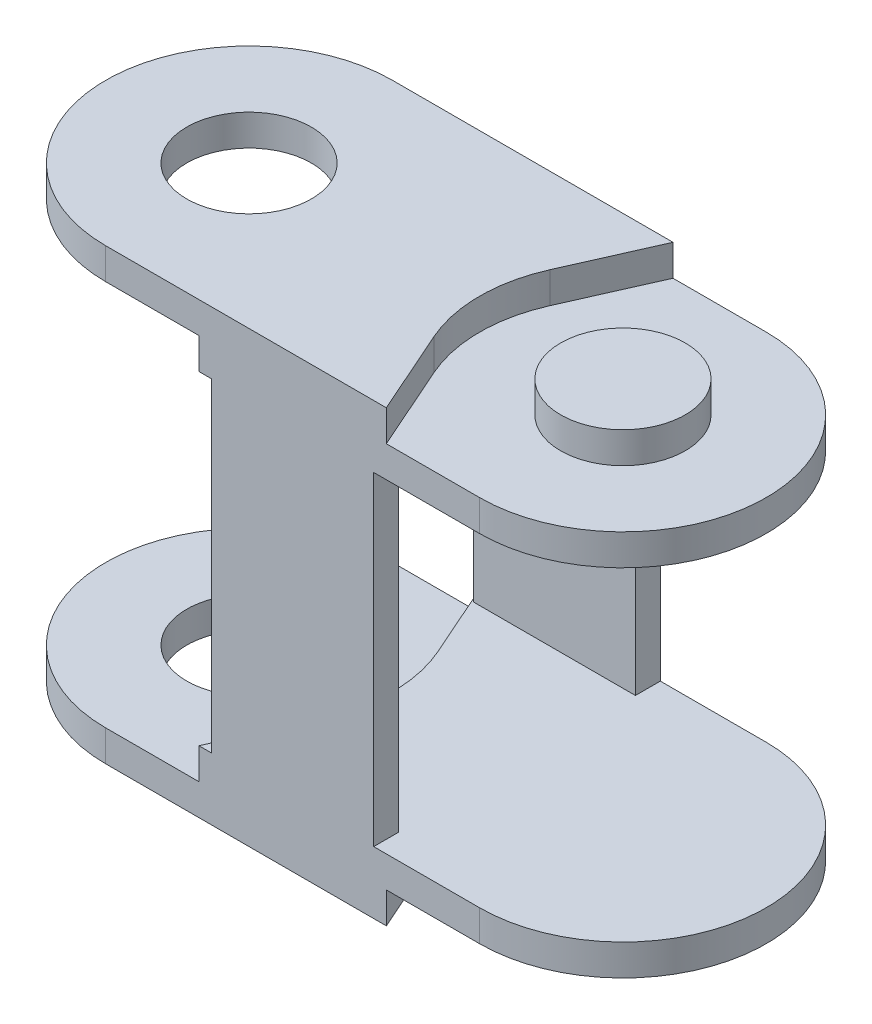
ISO-10303-21;
HEADER;
FILE_DESCRIPTION(('STEP AP214'),'2;1');
FILE_NAME('part.step','',(''),(''),'','','');
FILE_SCHEMA(('AUTOMOTIVE_DESIGN { 1 0 10303 214 1 1 1 1 }'));
ENDSEC;
DATA;
#1=APPLICATION_CONTEXT('core data for automotive mechanical design processes');
#2=APPLICATION_PROTOCOL_DEFINITION('international standard','automotive_design',2000,#1);
#3=PRODUCT_CONTEXT('',#1,'mechanical');
#4=PRODUCT('Part','Part','',(#3));
#5=PRODUCT_RELATED_PRODUCT_CATEGORY('part','',(#4));
#6=PRODUCT_DEFINITION_FORMATION('','',#4);
#7=PRODUCT_DEFINITION_CONTEXT('part definition',#1,'design');
#8=PRODUCT_DEFINITION('design','',#6,#7);
#9=PRODUCT_DEFINITION_SHAPE('','',#8);
#10=(LENGTH_UNIT() NAMED_UNIT(*) SI_UNIT(.MILLI.,.METRE.));
#11=(NAMED_UNIT(*) PLANE_ANGLE_UNIT() SI_UNIT($,.RADIAN.));
#12=(NAMED_UNIT(*) SI_UNIT($,.STERADIAN.) SOLID_ANGLE_UNIT());
#13=UNCERTAINTY_MEASURE_WITH_UNIT(LENGTH_MEASURE(1.E-05),#10,'distance_accuracy_value','');
#14=(GEOMETRIC_REPRESENTATION_CONTEXT(3) GLOBAL_UNCERTAINTY_ASSIGNED_CONTEXT((#13)) GLOBAL_UNIT_ASSIGNED_CONTEXT((#10,
#11,#12)) REPRESENTATION_CONTEXT('',''));
#15=CARTESIAN_POINT('',(0.,0.,0.));
#16=DIRECTION('',(0.,0.,1.));
#17=DIRECTION('',(1.,0.,0.));
#18=AXIS2_PLACEMENT_3D('',#15,#16,#17);
#19=CARTESIAN_POINT('',(9.99999999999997,-18.,5.63690605E-07));
#20=DIRECTION('',(0.,-1.,0.));
#21=DIRECTION('',(0.,0.,-1.));
#22=AXIS2_PLACEMENT_3D('',#19,#20,#21);
#23=PLANE('',#22);
#24=CARTESIAN_POINT('',(15.,-18.,8.45535737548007E-07));
#25=DIRECTION('',(0.,-1.,0.));
#26=DIRECTION('',(1.,0.,0.));
#27=AXIS2_PLACEMENT_3D('',#24,#25,#26);
#28=CIRCLE('',#27,5.);
#29=CARTESIAN_POINT('',(20.,-18.,8.45535737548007E-07));
#30=VERTEX_POINT('',#29);
#31=EDGE_CURVE('E18',#30,#30,#28,.F.);
#32=ORIENTED_EDGE('',*,*,#31,.F.);
#33=EDGE_LOOP('',(#32));
#34=FACE_BOUND('',#33,.T.);
#35=ADVANCED_FACE('F14',(#34),#23,.T.);
#36=CARTESIAN_POINT('',(20.1000005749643,18.,-5.09999915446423));
#37=DIRECTION('',(0.,1.,0.));
#38=DIRECTION('',(-0.999999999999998,0.,-5.63690533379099E-08));
#39=AXIS2_PLACEMENT_3D('',#36,#37,#38);
#40=PLANE('',#39);
#41=CARTESIAN_POINT('',(15.,18.,8.45535736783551E-07));
#42=DIRECTION('',(0.,1.,0.));
#43=DIRECTION('',(-1.,0.,0.));
#44=AXIS2_PLACEMENT_3D('',#41,#42,#43);
#45=CIRCLE('',#44,5.);
#46=CARTESIAN_POINT('',(10.,18.,8.45535736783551E-07));
#47=VERTEX_POINT('',#46);
#48=EDGE_CURVE('E313',#47,#47,#45,.F.);
#49=ORIENTED_EDGE('',*,*,#48,.F.);
#50=EDGE_LOOP('',(#49));
#51=FACE_BOUND('',#50,.T.);
#52=ADVANCED_FACE('F403',(#51),#40,.T.);
#53=CARTESIAN_POINT('',(15.,-13.,8.45535737E-07));
#54=DIRECTION('',(0.,-1.,0.));
#55=DIRECTION('',(1.,0.,0.));
#56=AXIS2_PLACEMENT_3D('',#53,#54,#55);
#57=CYLINDRICAL_SURFACE('',#56,5.);
#58=CARTESIAN_POINT('',(15.,-15.5,8.45535737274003E-07));
#59=DIRECTION('',(0.,-1.,0.));
#60=DIRECTION('',(1.,0.,0.));
#61=AXIS2_PLACEMENT_3D('',#58,#59,#60);
#62=CIRCLE('',#61,5.);
#63=CARTESIAN_POINT('',(20.,-15.5,8.45535737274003E-07));
#64=VERTEX_POINT('',#63);
#65=EDGE_CURVE('E389',#64,#64,#62,.F.);
#66=ORIENTED_EDGE('',*,*,#65,.F.);
#67=EDGE_LOOP('',(#66));
#68=FACE_BOUND('',#67,.T.);
#69=ORIENTED_EDGE('',*,*,#31,.T.);
#70=EDGE_LOOP('',(#69));
#71=FACE_BOUND('',#70,.T.);
#72=ADVANCED_FACE('F400',(#68,#71),#57,.T.);
#73=CARTESIAN_POINT('',(15.,-15.5,8.45535737E-07));
#74=DIRECTION('',(0.,-1.,0.));
#75=DIRECTION('',(1.,0.,0.));
#76=AXIS2_PLACEMENT_3D('',#73,#74,#75);
#77=CYLINDRICAL_SURFACE('',#76,11.5);
#78=DIRECTION('',(0.,1.,0.));
#79=VECTOR('',#78,1.);
#80=CARTESIAN_POINT('',(4.48515768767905,-15.5,-4.65704662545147));
#81=LINE('',#80,#79);
#82=CARTESIAN_POINT('',(4.48515768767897,-15.5,-4.65704662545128));
#83=VERTEX_POINT('',#82);
#84=CARTESIAN_POINT('',(4.48515789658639,-18.,-4.65704709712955));
#85=VERTEX_POINT('',#84);
#86=EDGE_CURVE('E319',#83,#85,#81,.F.);
#87=ORIENTED_EDGE('',*,*,#86,.F.);
#88=CARTESIAN_POINT('',(15.,-15.5,8.45535737E-07));
#89=DIRECTION('',(0.,-1.,0.));
#90=DIRECTION('',(1.,0.,0.));
#91=AXIS2_PLACEMENT_3D('',#88,#89,#90);
#92=CIRCLE('',#91,11.5);
#93=CARTESIAN_POINT('',(4.48515716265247,-15.5,4.65704713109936));
#94=VERTEX_POINT('',#93);
#95=EDGE_CURVE('E392',#94,#83,#92,.T.);
#96=ORIENTED_EDGE('',*,*,#95,.F.);
#97=DIRECTION('',(0.,1.,0.));
#98=VECTOR('',#97,1.);
#99=CARTESIAN_POINT('',(4.48515716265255,-15.5,4.65704713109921));
#100=LINE('',#99,#98);
#101=CARTESIAN_POINT('',(4.48515728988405,-18.,4.65704741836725));
#102=VERTEX_POINT('',#101);
#103=EDGE_CURVE('E240',#102,#94,#100,.T.);
#104=ORIENTED_EDGE('',*,*,#103,.F.);
#105=CARTESIAN_POINT('',(15.,-18.,8.45535737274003E-07));
#106=DIRECTION('',(0.,-1.,0.));
#107=DIRECTION('',(1.,0.,0.));
#108=AXIS2_PLACEMENT_3D('',#105,#106,#107);
#109=CIRCLE('',#108,11.5);
#110=EDGE_CURVE('E385',#85,#102,#109,.F.);
#111=ORIENTED_EDGE('',*,*,#110,.F.);
#112=EDGE_LOOP('',(#87,#96,#104,#111));
#113=FACE_BOUND('',#112,.T.);
#114=ADVANCED_FACE('F479',(#113),#77,.F.);
#115=CARTESIAN_POINT('',(-15.0000000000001,-15.5,-8.45535737E-07));
#116=DIRECTION('',(0.,-1.,0.));
#117=DIRECTION('',(1.,0.,0.));
#118=AXIS2_PLACEMENT_3D('',#115,#116,#117);
#119=CYLINDRICAL_SURFACE('',#118,5.);
#120=CARTESIAN_POINT('',(-15.0000000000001,-15.5,-8.45535737E-07));
#121=DIRECTION('',(0.,-1.,0.));
#122=DIRECTION('',(1.,0.,0.));
#123=AXIS2_PLACEMENT_3D('',#120,#121,#122);
#124=CIRCLE('',#123,5.);
#125=CARTESIAN_POINT('',(-10.0000000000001,-15.5,-8.45535737E-07));
#126=VERTEX_POINT('',#125);
#127=EDGE_CURVE('E368',#126,#126,#124,.F.);
#128=ORIENTED_EDGE('',*,*,#127,.T.);
#129=EDGE_LOOP('',(#128));
#130=FACE_BOUND('',#129,.T.);
#131=CARTESIAN_POINT('',(-15.0000000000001,-18.,-8.45535736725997E-07));
#132=DIRECTION('',(0.,-1.,0.));
#133=DIRECTION('',(1.,0.,0.));
#134=AXIS2_PLACEMENT_3D('',#131,#132,#133);
#135=CIRCLE('',#134,5.);
#136=CARTESIAN_POINT('',(-10.0000000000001,-18.,-8.45535736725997E-07));
#137=VERTEX_POINT('',#136);
#138=EDGE_CURVE('E380',#137,#137,#135,.F.);
#139=ORIENTED_EDGE('',*,*,#138,.F.);
#140=EDGE_LOOP('',(#139));
#141=FACE_BOUND('',#140,.T.);
#142=ADVANCED_FACE('F475',(#130,#141),#119,.F.);
#143=CARTESIAN_POINT('',(-15.0000000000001,15.5,-8.45535740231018E-07));
#144=DIRECTION('',(0.,1.,0.));
#145=DIRECTION('',(-1.,0.,0.));
#146=AXIS2_PLACEMENT_3D('',#143,#144,#145);
#147=CYLINDRICAL_SURFACE('',#146,5.);
#148=CARTESIAN_POINT('',(-15.0000000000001,15.5,-8.45535740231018E-07));
#149=DIRECTION('',(0.,1.,0.));
#150=DIRECTION('',(-1.,0.,0.));
#151=AXIS2_PLACEMENT_3D('',#148,#149,#150);
#152=CIRCLE('',#151,5.);
#153=CARTESIAN_POINT('',(-20.0000000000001,15.5,-8.45535740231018E-07));
#154=VERTEX_POINT('',#153);
#155=EDGE_CURVE('E307',#154,#154,#152,.F.);
#156=ORIENTED_EDGE('',*,*,#155,.T.);
#157=EDGE_LOOP('',(#156));
#158=FACE_BOUND('',#157,.T.);
#159=CARTESIAN_POINT('',(-15.0000000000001,18.,-8.45535740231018E-07));
#160=DIRECTION('',(0.,1.,0.));
#161=DIRECTION('',(-1.,0.,0.));
#162=AXIS2_PLACEMENT_3D('',#159,#160,#161);
#163=CIRCLE('',#162,5.);
#164=CARTESIAN_POINT('',(-20.0000000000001,18.,-8.45535740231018E-07));
#165=VERTEX_POINT('',#164);
#166=EDGE_CURVE('E354',#165,#165,#163,.F.);
#167=ORIENTED_EDGE('',*,*,#166,.F.);
#168=EDGE_LOOP('',(#167));
#169=FACE_BOUND('',#168,.T.);
#170=ADVANCED_FACE('F478',(#158,#169),#147,.F.);
#171=CARTESIAN_POINT('',(15.,18.0000000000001,8.45535734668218E-07));
#172=DIRECTION('',(0.,-1.,0.));
#173=DIRECTION('',(1.,0.,0.));
#174=AXIS2_PLACEMENT_3D('',#171,#172,#173);
#175=CYLINDRICAL_SURFACE('',#174,11.5);
#176=CARTESIAN_POINT('',(15.,15.5000000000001,8.45535734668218E-07));
#177=DIRECTION('',(0.,-1.,0.));
#178=DIRECTION('',(1.,0.,0.));
#179=AXIS2_PLACEMENT_3D('',#176,#177,#178);
#180=CIRCLE('',#179,11.5);
#181=CARTESIAN_POINT('',(4.48515768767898,15.5000000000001,-4.65704662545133));
#182=VERTEX_POINT('',#181);
#183=CARTESIAN_POINT('',(4.48515716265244,15.5000000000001,4.65704713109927));
#184=VERTEX_POINT('',#183);
#185=EDGE_CURVE('E352',#182,#184,#180,.F.);
#186=ORIENTED_EDGE('',*,*,#185,.F.);
#187=DIRECTION('',(0.,-1.,0.));
#188=VECTOR('',#187,1.);
#189=CARTESIAN_POINT('',(4.48515768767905,16.75,-4.65704662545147));
#190=LINE('',#189,#188);
#191=CARTESIAN_POINT('',(4.48515768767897,18.,-4.65704662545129));
#192=VERTEX_POINT('',#191);
#193=EDGE_CURVE('E314',#192,#182,#190,.T.);
#194=ORIENTED_EDGE('',*,*,#193,.F.);
#195=CARTESIAN_POINT('',(15.,18.,8.45535734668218E-07));
#196=DIRECTION('',(0.,-1.,0.));
#197=DIRECTION('',(1.,0.,0.));
#198=AXIS2_PLACEMENT_3D('',#195,#196,#197);
#199=CIRCLE('',#198,11.5);
#200=CARTESIAN_POINT('',(4.48515728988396,18.,4.65704741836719));
#201=VERTEX_POINT('',#200);
#202=EDGE_CURVE('E357',#201,#192,#199,.T.);
#203=ORIENTED_EDGE('',*,*,#202,.F.);
#204=DIRECTION('',(0.,1.,0.));
#205=VECTOR('',#204,1.);
#206=CARTESIAN_POINT('',(4.48515716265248,16.75,4.65704713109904));
#207=LINE('',#206,#205);
#208=EDGE_CURVE('E311',#184,#201,#207,.T.);
#209=ORIENTED_EDGE('',*,*,#208,.F.);
#210=EDGE_LOOP('',(#186,#194,#203,#209));
#211=FACE_BOUND('',#210,.T.);
#212=ADVANCED_FACE('F677',(#211),#175,.F.);
#213=CARTESIAN_POINT('',(15.,15.5,8.45535736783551E-07));
#214=DIRECTION('',(0.,1.,0.));
#215=DIRECTION('',(-1.,0.,0.));
#216=AXIS2_PLACEMENT_3D('',#213,#214,#215);
#217=CYLINDRICAL_SURFACE('',#216,5.);
#218=CARTESIAN_POINT('',(15.,15.5,8.45535736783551E-07));
#219=DIRECTION('',(0.,1.,0.));
#220=DIRECTION('',(-1.,0.,0.));
#221=AXIS2_PLACEMENT_3D('',#218,#219,#220);
#222=CIRCLE('',#221,5.);
#223=CARTESIAN_POINT('',(10.,15.5,8.45535736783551E-07));
#224=VERTEX_POINT('',#223);
#225=EDGE_CURVE('E348',#224,#224,#222,.F.);
#226=ORIENTED_EDGE('',*,*,#225,.F.);
#227=EDGE_LOOP('',(#226));
#228=FACE_BOUND('',#227,.T.);
#229=ORIENTED_EDGE('',*,*,#48,.T.);
#230=EDGE_LOOP('',(#229));
#231=FACE_BOUND('',#230,.T.);
#232=ADVANCED_FACE('F669',(#228,#231),#217,.T.);
#233=CARTESIAN_POINT('',(-15.0000000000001,-15.5,-8.45535740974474E-07));
#234=DIRECTION('',(0.,1.,0.));
#235=DIRECTION('',(-1.,0.,0.));
#236=AXIS2_PLACEMENT_3D('',#233,#234,#235);
#237=CYLINDRICAL_SURFACE('',#236,11.5);
#238=CARTESIAN_POINT('',(-15.0000000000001,-13.,-8.45535741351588E-07));
#239=DIRECTION('',(0.,1.,0.));
#240=DIRECTION('',(-1.,0.,0.));
#241=AXIS2_PLACEMENT_3D('',#238,#239,#240);
#242=CIRCLE('',#241,11.5);
#243=CARTESIAN_POINT('',(-4.48515768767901,-13.,4.6570466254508));
#244=VERTEX_POINT('',#243);
#245=CARTESIAN_POINT('',(-4.48515716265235,-13.,-4.65704713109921));
#246=VERTEX_POINT('',#245);
#247=EDGE_CURVE('E340',#244,#246,#242,.T.);
#248=ORIENTED_EDGE('',*,*,#247,.T.);
#249=DIRECTION('',(0.,1.,0.));
#250=VECTOR('',#249,1.);
#251=CARTESIAN_POINT('',(-4.48515716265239,-14.25,-4.6570471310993));
#252=LINE('',#251,#250);
#253=CARTESIAN_POINT('',(-4.48515716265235,-15.5,-4.65704713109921));
#254=VERTEX_POINT('',#253);
#255=EDGE_CURVE('E305',#254,#246,#252,.T.);
#256=ORIENTED_EDGE('',*,*,#255,.F.);
#257=CARTESIAN_POINT('',(-15.0000000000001,-15.5,-8.45535740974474E-07));
#258=DIRECTION('',(0.,1.,0.));
#259=DIRECTION('',(-1.,0.,0.));
#260=AXIS2_PLACEMENT_3D('',#257,#258,#259);
#261=CIRCLE('',#260,11.5);
#262=CARTESIAN_POINT('',(-4.48515768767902,-15.5,4.65704662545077));
#263=VERTEX_POINT('',#262);
#264=EDGE_CURVE('E375',#254,#263,#261,.F.);
#265=ORIENTED_EDGE('',*,*,#264,.T.);
#266=DIRECTION('',(0.,-1.,0.));
#267=VECTOR('',#266,1.);
#268=CARTESIAN_POINT('',(-4.4851576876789,-14.25,4.65704662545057));
#269=LINE('',#268,#267);
#270=EDGE_CURVE('E309',#244,#263,#269,.T.);
#271=ORIENTED_EDGE('',*,*,#270,.F.);
#272=EDGE_LOOP('',(#248,#256,#265,#271));
#273=FACE_BOUND('',#272,.T.);
#274=ADVANCED_FACE('F666',(#273),#237,.F.);
#275=CARTESIAN_POINT('',(4.48515716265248,15.5,4.65704713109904));
#276=DIRECTION('',(0.914334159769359,0.,-0.404960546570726));
#277=DIRECTION('',(0.,1.,0.));
#278=AXIS2_PLACEMENT_3D('',#275,#276,#277);
#279=PLANE('',#278);
#280=DIRECTION('',(0.404960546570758,0.,0.914334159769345));
#281=VECTOR('',#280,1.);
#282=CARTESIAN_POINT('',(4.48515716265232,15.5000000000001,4.65704713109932));
#283=LINE('',#282,#281);
#284=CARTESIAN_POINT('',(7.51591574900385,15.5,11.5000004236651));
#285=VERTEX_POINT('',#284);
#286=EDGE_CURVE('E351',#184,#285,#283,.T.);
#287=ORIENTED_EDGE('',*,*,#286,.F.);
#288=ORIENTED_EDGE('',*,*,#208,.T.);
#289=DIRECTION('',(-0.404960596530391,0.,-0.914334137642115));
#290=VECTOR('',#289,1.);
#291=CARTESIAN_POINT('',(7.51591704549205,18.,11.5000023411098));
#292=LINE('',#291,#290);
#293=CARTESIAN_POINT('',(7.51591597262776,18.,11.5000004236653));
#294=VERTEX_POINT('',#293);
#295=EDGE_CURVE('E359',#294,#201,#292,.T.);
#296=ORIENTED_EDGE('',*,*,#295,.F.);
#297=DIRECTION('',(0.,1.,0.));
#298=VECTOR('',#297,1.);
#299=CARTESIAN_POINT('',(7.51591574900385,0.,11.5000004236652));
#300=LINE('',#299,#298);
#301=EDGE_CURVE('E256',#285,#294,#300,.T.);
#302=ORIENTED_EDGE('',*,*,#301,.F.);
#303=EDGE_LOOP('',(#287,#288,#296,#302));
#304=FACE_BOUND('',#303,.T.);
#305=ADVANCED_FACE('F668',(#304),#279,.T.);
#306=CARTESIAN_POINT('',(-4.48515768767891,-13.,4.65704662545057));
#307=DIRECTION('',(-0.914334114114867,0.,-0.404960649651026));
#308=DIRECTION('',(0.,-1.,0.));
#309=AXIS2_PLACEMENT_3D('',#306,#307,#308);
#310=PLANE('',#309);
#311=DIRECTION('',(-0.404960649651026,0.,0.914334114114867));
#312=VECTOR('',#311,1.);
#313=CARTESIAN_POINT('',(-4.48515768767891,-13.,4.65704662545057));
#314=LINE('',#313,#312);
#315=CARTESIAN_POINT('',(-7.5159170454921,-13.,11.4999995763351));
#316=VERTEX_POINT('',#315);
#317=EDGE_CURVE('E343',#316,#244,#314,.F.);
#318=ORIENTED_EDGE('',*,*,#317,.T.);
#319=ORIENTED_EDGE('',*,*,#270,.T.);
#320=DIRECTION('',(-0.404960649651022,0.,0.914334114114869));
#321=VECTOR('',#320,1.);
#322=CARTESIAN_POINT('',(-4.48515768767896,-15.5,4.65704662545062));
#323=LINE('',#322,#321);
#324=CARTESIAN_POINT('',(-7.51591704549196,-15.5,11.4999995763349));
#325=VERTEX_POINT('',#324);
#326=EDGE_CURVE('E374',#263,#325,#323,.T.);
#327=ORIENTED_EDGE('',*,*,#326,.T.);
#328=DIRECTION('',(0.,-1.,0.));
#329=VECTOR('',#328,1.);
#330=CARTESIAN_POINT('',(-7.51591704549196,0.,11.4999995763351));
#331=LINE('',#330,#329);
#332=EDGE_CURVE('E276',#316,#325,#331,.T.);
#333=ORIENTED_EDGE('',*,*,#332,.F.);
#334=EDGE_LOOP('',(#318,#319,#327,#333));
#335=FACE_BOUND('',#334,.T.);
#336=ADVANCED_FACE('F473',(#335),#310,.T.);
#337=CARTESIAN_POINT('',(7.51591574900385,-15.5,11.5000004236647));
#338=DIRECTION('',(0.914334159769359,0.,-0.404960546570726));
#339=DIRECTION('',(-0.404960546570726,0.,-0.914334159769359));
#340=AXIS2_PLACEMENT_3D('',#337,#338,#339);
#341=PLANE('',#340);
#342=DIRECTION('',(-0.404960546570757,0.,-0.914334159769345));
#343=VECTOR('',#342,1.);
#344=CARTESIAN_POINT('',(7.51591574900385,-15.5,11.5000004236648));
#345=LINE('',#344,#343);
#346=CARTESIAN_POINT('',(7.51591574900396,-15.5,11.5000004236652));
#347=VERTEX_POINT('',#346);
#348=EDGE_CURVE('E239',#347,#94,#345,.T.);
#349=ORIENTED_EDGE('',*,*,#348,.F.);
#350=DIRECTION('',(0.,1.,0.));
#351=VECTOR('',#350,1.);
#352=CARTESIAN_POINT('',(7.51591574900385,0.,11.5000004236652));
#353=LINE('',#352,#351);
#354=CARTESIAN_POINT('',(7.51591597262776,-18.,11.5000004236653));
#355=VERTEX_POINT('',#354);
#356=EDGE_CURVE('E265',#355,#347,#353,.T.);
#357=ORIENTED_EDGE('',*,*,#356,.F.);
#358=DIRECTION('',(0.404960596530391,0.,0.914334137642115));
#359=VECTOR('',#358,1.);
#360=CARTESIAN_POINT('',(4.48515716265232,-18.,4.65704713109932));
#361=LINE('',#360,#359);
#362=EDGE_CURVE('E383',#102,#355,#361,.T.);
#363=ORIENTED_EDGE('',*,*,#362,.F.);
#364=ORIENTED_EDGE('',*,*,#103,.T.);
#365=EDGE_LOOP('',(#349,#357,#363,#364));
#366=FACE_BOUND('',#365,.T.);
#367=ADVANCED_FACE('F470',(#366),#341,.T.);
#368=CARTESIAN_POINT('',(15.,-13.,8.45535736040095E-07));
#369=DIRECTION('',(0.,-1.,0.));
#370=DIRECTION('',(0.,0.,-1.));
#371=AXIS2_PLACEMENT_3D('',#368,#369,#370);
#372=CYLINDRICAL_SURFACE('',#371,11.5);
#373=CARTESIAN_POINT('',(15.,-12.9999999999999,8.45535736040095E-07));
#374=DIRECTION('',(0.,-1.,0.));
#375=DIRECTION('',(0.,0.,-1.));
#376=AXIS2_PLACEMENT_3D('',#373,#374,#375);
#377=CIRCLE('',#376,11.5);
#378=CARTESIAN_POINT('',(15.0000006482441,-13.,-11.4999991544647));
#379=VERTEX_POINT('',#378);
#380=CARTESIAN_POINT('',(14.9999993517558,-12.9999999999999,11.500000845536));
#381=VERTEX_POINT('',#380);
#382=EDGE_CURVE('E346',#379,#381,#377,.T.);
#383=ORIENTED_EDGE('',*,*,#382,.T.);
#384=DIRECTION('',(0.,1.,0.));
#385=VECTOR('',#384,1.);
#386=CARTESIAN_POINT('',(14.9999993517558,0.,11.5000008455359));
#387=LINE('',#386,#385);
#388=CARTESIAN_POINT('',(14.9999993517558,-15.5,11.500000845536));
#389=VERTEX_POINT('',#388);
#390=EDGE_CURVE('E235',#389,#381,#387,.T.);
#391=ORIENTED_EDGE('',*,*,#390,.F.);
#392=CARTESIAN_POINT('',(15.,-15.5,8.45535736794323E-07));
#393=DIRECTION('',(0.,-1.,0.));
#394=DIRECTION('',(0.,0.,-1.));
#395=AXIS2_PLACEMENT_3D('',#392,#393,#394);
#396=CIRCLE('',#395,11.5);
#397=CARTESIAN_POINT('',(15.0000006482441,-15.5,-11.4999991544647));
#398=VERTEX_POINT('',#397);
#399=EDGE_CURVE('E233',#398,#389,#396,.T.);
#400=ORIENTED_EDGE('',*,*,#399,.F.);
#401=DIRECTION('',(0.,1.,0.));
#402=VECTOR('',#401,1.);
#403=CARTESIAN_POINT('',(15.0000006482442,-15.5,-11.4999991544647));
#404=LINE('',#403,#402);
#405=EDGE_CURVE('E219',#379,#398,#404,.F.);
#406=ORIENTED_EDGE('',*,*,#405,.F.);
#407=EDGE_LOOP('',(#383,#391,#400,#406));
#408=FACE_BOUND('',#407,.T.);
#409=ADVANCED_FACE('F234',(#408),#372,.T.);
#410=CARTESIAN_POINT('',(3.26999998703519,-15.5,-11.5000008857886));
#411=DIRECTION('',(0.,-1.,0.));
#412=DIRECTION('',(0.999999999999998,0.,5.63690532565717E-08));
#413=AXIS2_PLACEMENT_3D('',#410,#411,#412);
#414=PLANE('',#413);
#415=ORIENTED_EDGE('',*,*,#65,.T.);
#416=EDGE_LOOP('',(#415));
#417=FACE_BOUND('',#416,.T.);
#418=ORIENTED_EDGE('',*,*,#348,.T.);
#419=ORIENTED_EDGE('',*,*,#95,.T.);
#420=DIRECTION('',(0.404960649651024,0.,-0.914334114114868));
#421=VECTOR('',#420,1.);
#422=CARTESIAN_POINT('',(4.48515768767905,-15.5,-4.65704662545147));
#423=LINE('',#422,#421);
#424=CARTESIAN_POINT('',(7.51591704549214,-15.5,-11.4999995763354));
#425=VERTEX_POINT('',#424);
#426=EDGE_CURVE('E245',#425,#83,#423,.F.);
#427=ORIENTED_EDGE('',*,*,#426,.F.);
#428=DIRECTION('',(-0.999999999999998,0.,-5.6369052E-08));
#429=VECTOR('',#428,1.);
#430=CARTESIAN_POINT('',(7.51591704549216,-15.5,-11.4999995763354));
#431=LINE('',#430,#429);
#432=EDGE_CURVE('E224',#398,#425,#431,.T.);
#433=ORIENTED_EDGE('',*,*,#432,.F.);
#434=ORIENTED_EDGE('',*,*,#399,.T.);
#435=DIRECTION('',(0.999999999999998,0.,5.63690521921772E-08));
#436=VECTOR('',#435,1.);
#437=CARTESIAN_POINT('',(-6.48244171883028E-07,-15.5,11.5000000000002));
#438=LINE('',#437,#436);
#439=EDGE_CURVE('E260',#347,#389,#438,.T.);
#440=ORIENTED_EDGE('',*,*,#439,.F.);
#441=EDGE_LOOP('',(#418,#419,#427,#433,#434,#440));
#442=FACE_BOUND('',#441,.T.);
#443=ADVANCED_FACE('F243',(#417,#442),#414,.T.);
#444=CARTESIAN_POINT('',(4.48515768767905,-15.5,-4.65704662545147));
#445=DIRECTION('',(0.914334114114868,0.,0.404960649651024));
#446=DIRECTION('',(0.404960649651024,0.,-0.914334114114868));
#447=AXIS2_PLACEMENT_3D('',#444,#445,#446);
#448=PLANE('',#447);
#449=ORIENTED_EDGE('',*,*,#426,.T.);
#450=ORIENTED_EDGE('',*,*,#86,.T.);
#451=DIRECTION('',(-0.404960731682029,0.,0.914334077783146));
#452=VECTOR('',#451,1.);
#453=CARTESIAN_POINT('',(7.51591834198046,-18.,-11.5000008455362));
#454=LINE('',#453,#452);
#455=CARTESIAN_POINT('',(7.51591741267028,-18.,-11.4999995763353));
#456=VERTEX_POINT('',#455);
#457=EDGE_CURVE('E321',#456,#85,#454,.T.);
#458=ORIENTED_EDGE('',*,*,#457,.F.);
#459=DIRECTION('',(0.,1.,0.));
#460=VECTOR('',#459,1.);
#461=CARTESIAN_POINT('',(7.51591704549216,-15.5,-11.4999995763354));
#462=LINE('',#461,#460);
#463=EDGE_CURVE('E247',#425,#456,#462,.F.);
#464=ORIENTED_EDGE('',*,*,#463,.F.);
#465=EDGE_LOOP('',(#449,#450,#458,#464));
#466=FACE_BOUND('',#465,.T.);
#467=ADVANCED_FACE('F466',(#466),#448,.T.);
#468=CARTESIAN_POINT('',(7.51591704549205,-18.,11.5000023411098));
#469=DIRECTION('',(0.,-1.,0.));
#470=DIRECTION('',(-0.999999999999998,0.,-5.63690534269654E-08));
#471=AXIS2_PLACEMENT_3D('',#468,#469,#470);
#472=PLANE('',#471);
#473=ORIENTED_EDGE('',*,*,#138,.T.);
#474=EDGE_LOOP('',(#473));
#475=FACE_BOUND('',#474,.T.);
#476=DIRECTION('',(0.999999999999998,0.,5.63690521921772E-08));
#477=VECTOR('',#476,1.);
#478=CARTESIAN_POINT('',(-6.48244171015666E-07,-18.,11.5000000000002));
#479=LINE('',#478,#477);
#480=CARTESIAN_POINT('',(-15.0000006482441,-18.,11.4999991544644));
#481=VERTEX_POINT('',#480);
#482=EDGE_CURVE('E267',#481,#355,#479,.T.);
#483=ORIENTED_EDGE('',*,*,#482,.F.);
#484=CARTESIAN_POINT('',(-15.0000000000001,-18.,-8.45535736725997E-07));
#485=DIRECTION('',(0.,-1.,0.));
#486=DIRECTION('',(1.,0.,0.));
#487=AXIS2_PLACEMENT_3D('',#484,#485,#486);
#488=CIRCLE('',#487,11.5);
#489=CARTESIAN_POINT('',(-14.9999993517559,-18.,-11.5000008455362));
#490=VERTEX_POINT('',#489);
#491=EDGE_CURVE('E378',#490,#481,#488,.F.);
#492=ORIENTED_EDGE('',*,*,#491,.F.);
#493=DIRECTION('',(-0.999999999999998,0.,-5.6369052E-08));
#494=VECTOR('',#493,1.);
#495=CARTESIAN_POINT('',(7.51591704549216,-18.,-11.4999995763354));
#496=LINE('',#495,#494);
#497=EDGE_CURVE('E249',#456,#490,#496,.T.);
#498=ORIENTED_EDGE('',*,*,#497,.F.);
#499=ORIENTED_EDGE('',*,*,#457,.T.);
#500=ORIENTED_EDGE('',*,*,#110,.T.);
#501=ORIENTED_EDGE('',*,*,#362,.T.);
#502=EDGE_LOOP('',(#483,#492,#498,#499,#500,#501));
#503=FACE_BOUND('',#502,.T.);
#504=ADVANCED_FACE('F464',(#475,#503),#472,.T.);
#505=CARTESIAN_POINT('',(-15.0000000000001,-15.5,-8.45535737E-07));
#506=DIRECTION('',(0.,-1.,0.));
#507=DIRECTION('',(1.,0.,0.));
#508=AXIS2_PLACEMENT_3D('',#505,#506,#507);
#509=CYLINDRICAL_SURFACE('',#508,11.5);
#510=CARTESIAN_POINT('',(-15.0000000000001,-15.5,-8.45535737E-07));
#511=DIRECTION('',(0.,-1.,0.));
#512=DIRECTION('',(1.,0.,0.));
#513=AXIS2_PLACEMENT_3D('',#510,#511,#512);
#514=CIRCLE('',#513,11.5);
#515=CARTESIAN_POINT('',(-15.0000006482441,-15.5,11.4999991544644));
#516=VERTEX_POINT('',#515);
#517=CARTESIAN_POINT('',(-14.9999993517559,-15.5,-11.5000008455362));
#518=VERTEX_POINT('',#517);
#519=EDGE_CURVE('E371',#516,#518,#514,.T.);
#520=ORIENTED_EDGE('',*,*,#519,.T.);
#521=DIRECTION('',(0.,1.,0.));
#522=VECTOR('',#521,1.);
#523=CARTESIAN_POINT('',(-14.9999993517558,-15.5,-11.5000008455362));
#524=LINE('',#523,#522);
#525=EDGE_CURVE('E617',#490,#518,#524,.T.);
#526=ORIENTED_EDGE('',*,*,#525,.F.);
#527=ORIENTED_EDGE('',*,*,#491,.T.);
#528=DIRECTION('',(0.,-1.,0.));
#529=VECTOR('',#528,1.);
#530=CARTESIAN_POINT('',(-15.0000006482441,0.,11.4999991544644));
#531=LINE('',#530,#529);
#532=EDGE_CURVE('E270',#516,#481,#531,.T.);
#533=ORIENTED_EDGE('',*,*,#532,.F.);
#534=EDGE_LOOP('',(#520,#526,#527,#533));
#535=FACE_BOUND('',#534,.T.);
#536=ADVANCED_FACE('F460',(#535),#509,.T.);
#537=CARTESIAN_POINT('',(-3.62473154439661,-15.5,-2.04323328E-07));
#538=DIRECTION('',(0.,-1.,0.));
#539=DIRECTION('',(0.,0.,-1.));
#540=AXIS2_PLACEMENT_3D('',#537,#538,#539);
#541=PLANE('',#540);
#542=ORIENTED_EDGE('',*,*,#127,.F.);
#543=EDGE_LOOP('',(#542));
#544=FACE_BOUND('',#543,.T.);
#545=DIRECTION('',(-0.999999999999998,0.,-5.6369052E-08));
#546=VECTOR('',#545,1.);
#547=CARTESIAN_POINT('',(7.51591704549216,-15.5,-11.4999995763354));
#548=LINE('',#547,#546);
#549=CARTESIAN_POINT('',(-7.51591574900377,-15.5,-11.5000004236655));
#550=VERTEX_POINT('',#549);
#551=EDGE_CURVE('E613',#518,#550,#548,.F.);
#552=ORIENTED_EDGE('',*,*,#551,.F.);
#553=ORIENTED_EDGE('',*,*,#519,.F.);
#554=DIRECTION('',(-0.999999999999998,0.,-5.63690521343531E-08));
#555=VECTOR('',#554,1.);
#556=CARTESIAN_POINT('',(-6.48244171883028E-07,-15.5,11.5000000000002));
#557=LINE('',#556,#555);
#558=EDGE_CURVE('E273',#325,#516,#557,.T.);
#559=ORIENTED_EDGE('',*,*,#558,.F.);
#560=ORIENTED_EDGE('',*,*,#326,.F.);
#561=ORIENTED_EDGE('',*,*,#264,.F.);
#562=DIRECTION('',(0.404960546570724,0.,0.914334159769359));
#563=VECTOR('',#562,1.);
#564=CARTESIAN_POINT('',(-6.00053645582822,-15.5,-8.07852377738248));
#565=LINE('',#564,#563);
#566=EDGE_CURVE('E308',#550,#254,#565,.T.);
#567=ORIENTED_EDGE('',*,*,#566,.F.);
#568=EDGE_LOOP('',(#552,#553,#559,#560,#561,#567));
#569=FACE_BOUND('',#568,.T.);
#570=ADVANCED_FACE('F456',(#544,#569),#541,.F.);
#571=CARTESIAN_POINT('',(-7.51591574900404,-13.,-11.5000004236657));
#572=DIRECTION('',(-0.914334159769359,0.,0.404960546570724));
#573=DIRECTION('',(0.,-1.,0.));
#574=AXIS2_PLACEMENT_3D('',#571,#572,#573);
#575=PLANE('',#574);
#576=DIRECTION('',(0.404960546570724,0.,0.914334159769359));
#577=VECTOR('',#576,1.);
#578=CARTESIAN_POINT('',(-7.51591574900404,-13.,-11.5000004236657));
#579=LINE('',#578,#577);
#580=CARTESIAN_POINT('',(-7.51591574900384,-13.,-11.5000004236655));
#581=VERTEX_POINT('',#580);
#582=EDGE_CURVE('E336',#246,#581,#579,.F.);
#583=ORIENTED_EDGE('',*,*,#582,.T.);
#584=DIRECTION('',(0.,1.,0.));
#585=VECTOR('',#584,1.);
#586=CARTESIAN_POINT('',(-7.51591574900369,-15.5,-11.5000004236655));
#587=LINE('',#586,#585);
#588=EDGE_CURVE('E611',#550,#581,#587,.T.);
#589=ORIENTED_EDGE('',*,*,#588,.F.);
#590=ORIENTED_EDGE('',*,*,#566,.T.);
#591=ORIENTED_EDGE('',*,*,#255,.T.);
#592=EDGE_LOOP('',(#583,#589,#590,#591));
#593=FACE_BOUND('',#592,.T.);
#594=ADVANCED_FACE('F459',(#593),#575,.T.);
#595=CARTESIAN_POINT('',(-3.26999869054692,15.5,-11.5000008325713));
#596=DIRECTION('',(0.,1.,0.));
#597=DIRECTION('',(-0.999999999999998,0.,-5.63690533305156E-08));
#598=AXIS2_PLACEMENT_3D('',#595,#596,#597);
#599=PLANE('',#598);
#600=ORIENTED_EDGE('',*,*,#155,.F.);
#601=EDGE_LOOP('',(#600));
#602=FACE_BOUND('',#601,.T.);
#603=CARTESIAN_POINT('',(-15.0000000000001,15.5,-8.45535737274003E-07));
#604=DIRECTION('',(0.,1.,0.));
#605=DIRECTION('',(-1.,0.,0.));
#606=AXIS2_PLACEMENT_3D('',#603,#604,#605);
#607=CIRCLE('',#606,11.5);
#608=CARTESIAN_POINT('',(-4.48515716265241,15.5,-4.65704713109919));
#609=VERTEX_POINT('',#608);
#610=CARTESIAN_POINT('',(-4.48515768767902,15.5,4.65704662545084));
#611=VERTEX_POINT('',#610);
#612=EDGE_CURVE('E289',#609,#611,#607,.F.);
#613=ORIENTED_EDGE('',*,*,#612,.T.);
#614=DIRECTION('',(-0.404960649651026,0.,0.914334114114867));
#615=VECTOR('',#614,1.);
#616=CARTESIAN_POINT('',(-7.51591704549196,15.5000000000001,11.4999995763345));
#617=LINE('',#616,#615);
#618=CARTESIAN_POINT('',(-7.51591704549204,15.5000000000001,11.499999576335));
#619=VERTEX_POINT('',#618);
#620=EDGE_CURVE('E287',#619,#611,#617,.F.);
#621=ORIENTED_EDGE('',*,*,#620,.F.);
#622=DIRECTION('',(0.999999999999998,0.,5.63690521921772E-08));
#623=VECTOR('',#622,1.);
#624=CARTESIAN_POINT('',(-6.48244180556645E-07,15.5000000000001,11.5000000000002));
#625=LINE('',#624,#623);
#626=CARTESIAN_POINT('',(-15.0000006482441,15.5,11.4999991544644));
#627=VERTEX_POINT('',#626);
#628=EDGE_CURVE('E290',#627,#619,#625,.T.);
#629=ORIENTED_EDGE('',*,*,#628,.F.);
#630=CARTESIAN_POINT('',(-15.0000000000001,15.5,-8.45535739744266E-07));
#631=DIRECTION('',(0.,1.,0.));
#632=DIRECTION('',(-1.,0.,0.));
#633=AXIS2_PLACEMENT_3D('',#630,#631,#632);
#634=CIRCLE('',#633,11.5);
#635=CARTESIAN_POINT('',(-14.9999993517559,15.5,-11.5000008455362));
#636=VERTEX_POINT('',#635);
#637=EDGE_CURVE('E364',#636,#627,#634,.T.);
#638=ORIENTED_EDGE('',*,*,#637,.F.);
#639=DIRECTION('',(-0.999999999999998,0.,-5.6369052E-08));
#640=VECTOR('',#639,1.);
#641=CARTESIAN_POINT('',(7.51591704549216,15.5,-11.4999995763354));
#642=LINE('',#641,#640);
#643=CARTESIAN_POINT('',(-7.51591574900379,15.5,-11.5000004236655));
#644=VERTEX_POINT('',#643);
#645=EDGE_CURVE('E572',#644,#636,#642,.T.);
#646=ORIENTED_EDGE('',*,*,#645,.F.);
#647=DIRECTION('',(0.404960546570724,0.,0.914334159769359));
#648=VECTOR('',#647,1.);
#649=CARTESIAN_POINT('',(-4.4851571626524,15.5,-4.65704713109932));
#650=LINE('',#649,#648);
#651=EDGE_CURVE('E564',#609,#644,#650,.F.);
#652=ORIENTED_EDGE('',*,*,#651,.F.);
#653=EDGE_LOOP('',(#613,#621,#629,#638,#646,#652));
#654=FACE_BOUND('',#653,.T.);
#655=ADVANCED_FACE('F502',(#602,#654),#599,.F.);
#656=CARTESIAN_POINT('',(-15.0000000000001,15.5,-8.45535739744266E-07));
#657=DIRECTION('',(0.,1.,0.));
#658=DIRECTION('',(-1.,0.,0.));
#659=AXIS2_PLACEMENT_3D('',#656,#657,#658);
#660=CYLINDRICAL_SURFACE('',#659,11.5);
#661=ORIENTED_EDGE('',*,*,#637,.T.);
#662=DIRECTION('',(0.,-1.,0.));
#663=VECTOR('',#662,1.);
#664=CARTESIAN_POINT('',(-15.0000006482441,0.,11.4999991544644));
#665=LINE('',#664,#663);
#666=CARTESIAN_POINT('',(-15.0000006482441,18.,11.4999991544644));
#667=VERTEX_POINT('',#666);
#668=EDGE_CURVE('E293',#667,#627,#665,.T.);
#669=ORIENTED_EDGE('',*,*,#668,.F.);
#670=CARTESIAN_POINT('',(-15.0000000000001,18.,-8.45535740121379E-07));
#671=DIRECTION('',(0.,1.,0.));
#672=DIRECTION('',(-1.,0.,0.));
#673=AXIS2_PLACEMENT_3D('',#670,#671,#672);
#674=CIRCLE('',#673,11.5);
#675=CARTESIAN_POINT('',(-14.9999993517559,18.,-11.5000008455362));
#676=VERTEX_POINT('',#675);
#677=EDGE_CURVE('E362',#676,#667,#674,.T.);
#678=ORIENTED_EDGE('',*,*,#677,.F.);
#679=DIRECTION('',(0.,1.,0.));
#680=VECTOR('',#679,1.);
#681=CARTESIAN_POINT('',(-14.9999993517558,-15.5,-11.5000008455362));
#682=LINE('',#681,#680);
#683=EDGE_CURVE('E604',#636,#676,#682,.T.);
#684=ORIENTED_EDGE('',*,*,#683,.F.);
#685=EDGE_LOOP('',(#661,#669,#678,#684));
#686=FACE_BOUND('',#685,.T.);
#687=ADVANCED_FACE('F506',(#686),#660,.T.);
#688=CARTESIAN_POINT('',(7.51591834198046,18.,-11.5000008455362));
#689=DIRECTION('',(0.,1.,0.));
#690=DIRECTION('',(-0.999999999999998,0.,-5.63690534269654E-08));
#691=AXIS2_PLACEMENT_3D('',#688,#689,#690);
#692=PLANE('',#691);
#693=ORIENTED_EDGE('',*,*,#166,.T.);
#694=EDGE_LOOP('',(#693));
#695=FACE_BOUND('',#694,.T.);
#696=ORIENTED_EDGE('',*,*,#202,.T.);
#697=DIRECTION('',(-0.404960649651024,0.,0.914334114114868));
#698=VECTOR('',#697,1.);
#699=CARTESIAN_POINT('',(6.00053736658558,18.,-8.07852310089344));
#700=LINE('',#699,#698);
#701=CARTESIAN_POINT('',(7.51591704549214,18.,-11.4999995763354));
#702=VERTEX_POINT('',#701);
#703=EDGE_CURVE('E317',#702,#192,#700,.T.);
#704=ORIENTED_EDGE('',*,*,#703,.F.);
#705=DIRECTION('',(-0.999999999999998,0.,-5.6369052E-08));
#706=VECTOR('',#705,1.);
#707=CARTESIAN_POINT('',(7.51591704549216,18.,-11.4999995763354));
#708=LINE('',#707,#706);
#709=EDGE_CURVE('E600',#676,#702,#708,.F.);
#710=ORIENTED_EDGE('',*,*,#709,.F.);
#711=ORIENTED_EDGE('',*,*,#677,.T.);
#712=DIRECTION('',(-0.999999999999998,0.,-5.63690521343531E-08));
#713=VECTOR('',#712,1.);
#714=CARTESIAN_POINT('',(-6.48244182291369E-07,18.,11.5000000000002));
#715=LINE('',#714,#713);
#716=EDGE_CURVE('E296',#294,#667,#715,.T.);
#717=ORIENTED_EDGE('',*,*,#716,.F.);
#718=ORIENTED_EDGE('',*,*,#295,.T.);
#719=EDGE_LOOP('',(#696,#704,#710,#711,#717,#718));
#720=FACE_BOUND('',#719,.T.);
#721=ADVANCED_FACE('F510',(#695,#720),#692,.T.);
#722=CARTESIAN_POINT('',(7.51591704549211,15.5,-11.4999995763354));
#723=DIRECTION('',(0.914334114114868,0.,0.404960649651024));
#724=DIRECTION('',(0.,1.,0.));
#725=AXIS2_PLACEMENT_3D('',#722,#723,#724);
#726=PLANE('',#725);
#727=DIRECTION('',(-0.404960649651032,0.,0.914334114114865));
#728=VECTOR('',#727,1.);
#729=CARTESIAN_POINT('',(7.51591704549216,15.5000000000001,-11.4999995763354));
#730=LINE('',#729,#728);
#731=CARTESIAN_POINT('',(7.51591698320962,15.5,-11.4999994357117));
#732=VERTEX_POINT('',#731);
#733=EDGE_CURVE('E316',#732,#182,#730,.T.);
#734=ORIENTED_EDGE('',*,*,#733,.F.);
#735=DIRECTION('',(0.,1.,0.));
#736=VECTOR('',#735,1.);
#737=CARTESIAN_POINT('',(7.51591704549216,-15.5,-11.4999995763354));
#738=LINE('',#737,#736);
#739=EDGE_CURVE('E595',#702,#732,#738,.F.);
#740=ORIENTED_EDGE('',*,*,#739,.F.);
#741=ORIENTED_EDGE('',*,*,#703,.T.);
#742=ORIENTED_EDGE('',*,*,#193,.T.);
#743=EDGE_LOOP('',(#734,#740,#741,#742));
#744=FACE_BOUND('',#743,.T.);
#745=ADVANCED_FACE('F454',(#744),#726,.T.);
#746=CARTESIAN_POINT('',(14.9999993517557,15.5000000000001,11.5000008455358));
#747=DIRECTION('',(0.,1.,0.));
#748=DIRECTION('',(0.,0.,1.));
#749=AXIS2_PLACEMENT_3D('',#746,#747,#748);
#750=PLANE('',#749);
#751=ORIENTED_EDGE('',*,*,#225,.T.);
#752=EDGE_LOOP('',(#751));
#753=FACE_BOUND('',#752,.T.);
#754=CARTESIAN_POINT('',(15.,15.5,8.45535736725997E-07));
#755=DIRECTION('',(0.,1.,0.));
#756=DIRECTION('',(-1.,0.,0.));
#757=AXIS2_PLACEMENT_3D('',#754,#755,#756);
#758=CIRCLE('',#757,11.5);
#759=CARTESIAN_POINT('',(15.0000006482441,15.5,-11.4999991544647));
#760=VERTEX_POINT('',#759);
#761=CARTESIAN_POINT('',(14.9999993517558,15.5,11.5000008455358));
#762=VERTEX_POINT('',#761);
#763=EDGE_CURVE('E263',#760,#762,#758,.F.);
#764=ORIENTED_EDGE('',*,*,#763,.F.);
#765=DIRECTION('',(-0.999999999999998,0.,-5.6369052E-08));
#766=VECTOR('',#765,1.);
#767=CARTESIAN_POINT('',(7.51591704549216,15.5,-11.4999995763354));
#768=LINE('',#767,#766);
#769=EDGE_CURVE('E593',#732,#760,#768,.F.);
#770=ORIENTED_EDGE('',*,*,#769,.F.);
#771=ORIENTED_EDGE('',*,*,#733,.T.);
#772=ORIENTED_EDGE('',*,*,#185,.T.);
#773=ORIENTED_EDGE('',*,*,#286,.T.);
#774=DIRECTION('',(-0.999999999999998,0.,-5.63690521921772E-08));
#775=VECTOR('',#774,1.);
#776=CARTESIAN_POINT('',(-6.48244181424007E-07,15.5,11.5000000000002));
#777=LINE('',#776,#775);
#778=EDGE_CURVE('E253',#762,#285,#777,.T.);
#779=ORIENTED_EDGE('',*,*,#778,.F.);
#780=EDGE_LOOP('',(#764,#770,#771,#772,#773,#779));
#781=FACE_BOUND('',#780,.T.);
#782=ADVANCED_FACE('F451',(#753,#781),#750,.T.);
#783=CARTESIAN_POINT('',(-7.51591704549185,-13.,-11.5000023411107));
#784=DIRECTION('',(0.,-1.,0.));
#785=DIRECTION('',(0.999999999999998,0.,5.63690533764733E-08));
#786=AXIS2_PLACEMENT_3D('',#783,#784,#785);
#787=PLANE('',#786);
#788=DIRECTION('',(0.999999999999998,0.,5.6369053E-08));
#789=VECTOR('',#788,1.);
#790=CARTESIAN_POINT('',(-7.49999946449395,-13.,-9.50000042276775));
#791=LINE('',#790,#789);
#792=CARTESIAN_POINT('',(-6.49999946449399,-13.,-9.50000036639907));
#793=VERTEX_POINT('',#792);
#794=CARTESIAN_POINT('',(6.50000053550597,-13.,-9.49999963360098));
#795=VERTEX_POINT('',#794);
#796=EDGE_CURVE('E339',#793,#795,#791,.T.);
#797=ORIENTED_EDGE('',*,*,#796,.F.);
#798=DIRECTION('',(5.6369053E-08,0.,-0.999999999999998));
#799=VECTOR('',#798,1.);
#800=CARTESIAN_POINT('',(-6.49999940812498,-13.,-10.5000003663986));
#801=LINE('',#800,#799);
#802=CARTESIAN_POINT('',(-6.4999993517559,-13.,-11.5000003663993));
#803=VERTEX_POINT('',#802);
#804=EDGE_CURVE('E582',#793,#803,#801,.T.);
#805=ORIENTED_EDGE('',*,*,#804,.T.);
#806=DIRECTION('',(-0.999999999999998,0.,-5.6369052E-08));
#807=VECTOR('',#806,1.);
#808=CARTESIAN_POINT('',(7.51591704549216,-13.,-11.4999995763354));
#809=LINE('',#808,#807);
#810=EDGE_CURVE('E575',#581,#803,#809,.F.);
#811=ORIENTED_EDGE('',*,*,#810,.F.);
#812=ORIENTED_EDGE('',*,*,#582,.F.);
#813=ORIENTED_EDGE('',*,*,#247,.F.);
#814=ORIENTED_EDGE('',*,*,#317,.F.);
#815=DIRECTION('',(-0.999999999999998,0.,-5.63690521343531E-08));
#816=VECTOR('',#815,1.);
#817=CARTESIAN_POINT('',(-6.4824417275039E-07,-13.,11.5000000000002));
#818=LINE('',#817,#816);
#819=CARTESIAN_POINT('',(-6.50000064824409,-13.,11.4999996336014));
#820=VERTEX_POINT('',#819);
#821=EDGE_CURVE('E278',#820,#316,#818,.T.);
#822=ORIENTED_EDGE('',*,*,#821,.F.);
#823=DIRECTION('',(5.63690530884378E-08,0.,-0.999999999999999));
#824=VECTOR('',#823,1.);
#825=CARTESIAN_POINT('',(-6.50000059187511,-13.,10.4999996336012));
#826=LINE('',#825,#824);
#827=CARTESIAN_POINT('',(-6.50000053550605,-13.,9.49999963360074));
#828=VERTEX_POINT('',#827);
#829=EDGE_CURVE('E282',#820,#828,#826,.T.);
#830=ORIENTED_EDGE('',*,*,#829,.T.);
#831=DIRECTION('',(-0.999999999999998,0.,-5.63690533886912E-08));
#832=VECTOR('',#831,1.);
#833=CARTESIAN_POINT('',(-5.35506024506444E-07,-13.,9.49999999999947));
#834=LINE('',#833,#832);
#835=CARTESIAN_POINT('',(6.49999946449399,-13.,9.50000036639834));
#836=VERTEX_POINT('',#835);
#837=EDGE_CURVE('E285',#836,#828,#834,.T.);
#838=ORIENTED_EDGE('',*,*,#837,.F.);
#839=DIRECTION('',(5.63690530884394E-08,0.,-0.999999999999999));
#840=VECTOR('',#839,1.);
#841=CARTESIAN_POINT('',(6.49999940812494,-13.,10.5000003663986));
#842=LINE('',#841,#840);
#843=CARTESIAN_POINT('',(6.49999935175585,-13.,11.5000003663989));
#844=VERTEX_POINT('',#843);
#845=EDGE_CURVE('E300',#844,#836,#842,.T.);
#846=ORIENTED_EDGE('',*,*,#845,.F.);
#847=DIRECTION('',(-0.999999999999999,0.,-5.63690521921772E-08));
#848=VECTOR('',#847,1.);
#849=CARTESIAN_POINT('',(-6.48244171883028E-07,-13.,11.5000000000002));
#850=LINE('',#849,#848);
#851=EDGE_CURVE('E259',#381,#844,#850,.T.);
#852=ORIENTED_EDGE('',*,*,#851,.F.);
#853=ORIENTED_EDGE('',*,*,#382,.F.);
#854=DIRECTION('',(-0.999999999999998,0.,-5.6369052E-08));
#855=VECTOR('',#854,1.);
#856=CARTESIAN_POINT('',(7.51591704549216,-13.,-11.4999995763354));
#857=LINE('',#856,#855);
#858=CARTESIAN_POINT('',(6.50000064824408,-13.,-11.4999996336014));
#859=VERTEX_POINT('',#858);
#860=EDGE_CURVE('E227',#859,#379,#857,.F.);
#861=ORIENTED_EDGE('',*,*,#860,.F.);
#862=DIRECTION('',(5.6369053E-08,0.,-0.999999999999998));
#863=VECTOR('',#862,1.);
#864=CARTESIAN_POINT('',(6.50000053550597,-13.,-9.49999963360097));
#865=LINE('',#864,#863);
#866=EDGE_CURVE('E589',#795,#859,#865,.T.);
#867=ORIENTED_EDGE('',*,*,#866,.F.);
#868=EDGE_LOOP('',(#797,#805,#811,#812,#813,#814,#822,#830,#838,#846,#852,#853,#861,#867));
#869=FACE_BOUND('',#868,.T.);
#870=ADVANCED_FACE('F449',(#869),#787,.F.);
#871=CARTESIAN_POINT('',(-7.49999946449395,18.,-9.50000042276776));
#872=DIRECTION('',(-5.6369053E-08,0.,0.999999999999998));
#873=DIRECTION('',(0.999999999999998,0.,5.6369053E-08));
#874=AXIS2_PLACEMENT_3D('',#871,#872,#873);
#875=PLANE('',#874);
#876=DIRECTION('',(1.,0.,0.));
#877=VECTOR('',#876,1.);
#878=CARTESIAN_POINT('',(3.6247315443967,13.,-9.49999963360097));
#879=LINE('',#878,#877);
#880=CARTESIAN_POINT('',(6.50000059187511,13.,-9.49999963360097));
#881=VERTEX_POINT('',#880);
#882=CARTESIAN_POINT('',(-6.49999946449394,13.,-9.49999987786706));
#883=VERTEX_POINT('',#882);
#884=EDGE_CURVE('E578',#881,#883,#879,.F.);
#885=ORIENTED_EDGE('',*,*,#884,.T.);
#886=DIRECTION('',(0.,1.,0.));
#887=VECTOR('',#886,1.);
#888=CARTESIAN_POINT('',(-6.49999946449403,0.,-9.50000036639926));
#889=LINE('',#888,#887);
#890=EDGE_CURVE('E579',#883,#793,#889,.F.);
#891=ORIENTED_EDGE('',*,*,#890,.T.);
#892=ORIENTED_EDGE('',*,*,#796,.T.);
#893=DIRECTION('',(0.,1.,0.));
#894=VECTOR('',#893,1.);
#895=CARTESIAN_POINT('',(6.50000053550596,18.,-9.49999963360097));
#896=LINE('',#895,#894);
#897=EDGE_CURVE('E585',#881,#795,#896,.F.);
#898=ORIENTED_EDGE('',*,*,#897,.F.);
#899=EDGE_LOOP('',(#885,#891,#892,#898));
#900=FACE_BOUND('',#899,.T.);
#901=ADVANCED_FACE('F445',(#900),#875,.T.);
#902=CARTESIAN_POINT('',(-6.49999940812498,0.,-10.5000003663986));
#903=DIRECTION('',(0.999999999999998,0.,5.6369053E-08));
#904=DIRECTION('',(5.6369053E-08,0.,-0.999999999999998));
#905=AXIS2_PLACEMENT_3D('',#902,#903,#904);
#906=PLANE('',#905);
#907=ORIENTED_EDGE('',*,*,#890,.F.);
#908=DIRECTION('',(0.,0.,1.));
#909=VECTOR('',#908,1.);
#910=CARTESIAN_POINT('',(-6.4999994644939,13.,2.04322362E-07));
#911=LINE('',#910,#909);
#912=CARTESIAN_POINT('',(-6.49999942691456,13.,-11.5000003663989));
#913=VERTEX_POINT('',#912);
#914=EDGE_CURVE('E568',#883,#913,#911,.F.);
#915=ORIENTED_EDGE('',*,*,#914,.T.);
#916=DIRECTION('',(0.,1.,0.));
#917=VECTOR('',#916,1.);
#918=CARTESIAN_POINT('',(-6.49999935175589,-15.5,-11.5000003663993));
#919=LINE('',#918,#917);
#920=EDGE_CURVE('E573',#803,#913,#919,.T.);
#921=ORIENTED_EDGE('',*,*,#920,.F.);
#922=ORIENTED_EDGE('',*,*,#804,.F.);
#923=EDGE_LOOP('',(#907,#915,#921,#922));
#924=FACE_BOUND('',#923,.T.);
#925=ADVANCED_FACE('F441',(#924),#906,.F.);
#926=CARTESIAN_POINT('',(-4.4851571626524,13.,-4.65704713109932));
#927=DIRECTION('',(-0.914334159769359,0.,0.404960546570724));
#928=DIRECTION('',(0.404960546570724,0.,0.914334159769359));
#929=AXIS2_PLACEMENT_3D('',#926,#927,#928);
#930=PLANE('',#929);
#931=DIRECTION('',(0.404960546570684,0.,0.914334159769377));
#932=VECTOR('',#931,1.);
#933=CARTESIAN_POINT('',(-7.51591574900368,13.,-11.5000004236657));
#934=LINE('',#933,#932);
#935=CARTESIAN_POINT('',(-7.5159157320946,13.,-11.5000003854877));
#936=VERTEX_POINT('',#935);
#937=CARTESIAN_POINT('',(-4.48515716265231,13.,-4.65704713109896));
#938=VERTEX_POINT('',#937);
#939=EDGE_CURVE('E330',#936,#938,#934,.T.);
#940=ORIENTED_EDGE('',*,*,#939,.T.);
#941=DIRECTION('',(0.,1.,0.));
#942=VECTOR('',#941,1.);
#943=CARTESIAN_POINT('',(-4.48515716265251,13.,-4.65704713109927));
#944=LINE('',#943,#942);
#945=EDGE_CURVE('E335',#938,#609,#944,.T.);
#946=ORIENTED_EDGE('',*,*,#945,.T.);
#947=ORIENTED_EDGE('',*,*,#651,.T.);
#948=DIRECTION('',(0.,1.,0.));
#949=VECTOR('',#948,1.);
#950=CARTESIAN_POINT('',(-7.51591574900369,-15.5,-11.5000004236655));
#951=LINE('',#950,#949);
#952=EDGE_CURVE('E569',#936,#644,#951,.T.);
#953=ORIENTED_EDGE('',*,*,#952,.F.);
#954=EDGE_LOOP('',(#940,#946,#947,#953));
#955=FACE_BOUND('',#954,.T.);
#956=ADVANCED_FACE('F437',(#955),#930,.T.);
#957=CARTESIAN_POINT('',(-15.0000000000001,13.,-8.45535737E-07));
#958=DIRECTION('',(0.,1.,0.));
#959=DIRECTION('',(-1.,0.,0.));
#960=AXIS2_PLACEMENT_3D('',#957,#958,#959);
#961=CYLINDRICAL_SURFACE('',#960,11.5);
#962=ORIENTED_EDGE('',*,*,#945,.F.);
#963=CARTESIAN_POINT('',(-15.0000000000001,13.,-8.45535737E-07));
#964=DIRECTION('',(0.,1.,0.));
#965=DIRECTION('',(-1.,0.,0.));
#966=AXIS2_PLACEMENT_3D('',#963,#964,#965);
#967=CIRCLE('',#966,11.5);
#968=CARTESIAN_POINT('',(-4.48515768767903,13.0000000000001,4.65704662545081));
#969=VERTEX_POINT('',#968);
#970=EDGE_CURVE('E326',#938,#969,#967,.F.);
#971=ORIENTED_EDGE('',*,*,#970,.T.);
#972=DIRECTION('',(0.,1.,0.));
#973=VECTOR('',#972,1.);
#974=CARTESIAN_POINT('',(-4.48515768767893,13.0000000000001,4.65704662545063));
#975=LINE('',#974,#973);
#976=EDGE_CURVE('E286',#611,#969,#975,.F.);
#977=ORIENTED_EDGE('',*,*,#976,.F.);
#978=ORIENTED_EDGE('',*,*,#612,.F.);
#979=EDGE_LOOP('',(#962,#971,#977,#978));
#980=FACE_BOUND('',#979,.T.);
#981=ADVANCED_FACE('F433',(#980),#961,.F.);
#982=CARTESIAN_POINT('',(-7.51591704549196,13.0000000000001,11.4999995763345));
#983=DIRECTION('',(-0.914334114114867,0.,-0.404960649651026));
#984=DIRECTION('',(-0.404960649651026,0.,0.914334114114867));
#985=AXIS2_PLACEMENT_3D('',#982,#983,#984);
#986=PLANE('',#985);
#987=DIRECTION('',(-0.404960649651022,0.,0.914334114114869));
#988=VECTOR('',#987,1.);
#989=CARTESIAN_POINT('',(-4.48515768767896,13.,4.65704662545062));
#990=LINE('',#989,#988);
#991=CARTESIAN_POINT('',(-7.51591704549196,13.,11.4999995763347));
#992=VERTEX_POINT('',#991);
#993=EDGE_CURVE('E329',#969,#992,#990,.T.);
#994=ORIENTED_EDGE('',*,*,#993,.T.);
#995=DIRECTION('',(0.,-1.,0.));
#996=VECTOR('',#995,1.);
#997=CARTESIAN_POINT('',(-7.51591704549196,0.,11.4999995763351));
#998=LINE('',#997,#996);
#999=EDGE_CURVE('E292',#619,#992,#998,.T.);
#1000=ORIENTED_EDGE('',*,*,#999,.F.);
#1001=ORIENTED_EDGE('',*,*,#620,.T.);
#1002=ORIENTED_EDGE('',*,*,#976,.T.);
#1003=EDGE_LOOP('',(#994,#1000,#1001,#1002));
#1004=FACE_BOUND('',#1003,.T.);
#1005=ADVANCED_FACE('F429',(#1004),#986,.T.);
#1006=CARTESIAN_POINT('',(-6.50000064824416,-13.,11.4999996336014));
#1007=DIRECTION('',(0.999999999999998,0.,5.63690530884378E-08));
#1008=DIRECTION('',(5.63690530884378E-08,0.,-0.999999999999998));
#1009=AXIS2_PLACEMENT_3D('',#1006,#1007,#1008);
#1010=PLANE('',#1009);
#1011=DIRECTION('',(0.,-1.,0.));
#1012=VECTOR('',#1011,1.);
#1013=CARTESIAN_POINT('',(-6.50000064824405,0.,11.4999996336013));
#1014=LINE('',#1013,#1012);
#1015=CARTESIAN_POINT('',(-6.50000064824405,13.,11.4999995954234));
#1016=VERTEX_POINT('',#1015);
#1017=EDGE_CURVE('E281',#1016,#820,#1014,.T.);
#1018=ORIENTED_EDGE('',*,*,#1017,.F.);
#1019=DIRECTION('',(0.,0.,1.));
#1020=VECTOR('',#1019,1.);
#1021=CARTESIAN_POINT('',(-6.50000064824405,13.,2.04322362E-07));
#1022=LINE('',#1021,#1020);
#1023=CARTESIAN_POINT('',(-6.50000061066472,13.,9.49999963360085));
#1024=VERTEX_POINT('',#1023);
#1025=EDGE_CURVE('E546',#1016,#1024,#1022,.F.);
#1026=ORIENTED_EDGE('',*,*,#1025,.T.);
#1027=DIRECTION('',(0.,1.,0.));
#1028=VECTOR('',#1027,1.);
#1029=CARTESIAN_POINT('',(-6.50000053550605,0.,9.49999963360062));
#1030=LINE('',#1029,#1028);
#1031=EDGE_CURVE('E303',#828,#1024,#1030,.T.);
#1032=ORIENTED_EDGE('',*,*,#1031,.F.);
#1033=ORIENTED_EDGE('',*,*,#829,.F.);
#1034=EDGE_LOOP('',(#1018,#1026,#1032,#1033));
#1035=FACE_BOUND('',#1034,.T.);
#1036=ADVANCED_FACE('F432',(#1035),#1010,.F.);
#1037=CARTESIAN_POINT('',(-6.50000053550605,-13.,9.49999963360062));
#1038=DIRECTION('',(5.63690533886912E-08,0.,-0.999999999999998));
#1039=DIRECTION('',(0.,1.,0.));
#1040=AXIS2_PLACEMENT_3D('',#1037,#1038,#1039);
#1041=PLANE('',#1040);
#1042=DIRECTION('',(1.,0.,0.));
#1043=VECTOR('',#1042,1.);
#1044=CARTESIAN_POINT('',(3.6247315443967,13.,9.49999963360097));
#1045=LINE('',#1044,#1043);
#1046=CARTESIAN_POINT('',(6.49999946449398,13.,9.49999987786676));
#1047=VERTEX_POINT('',#1046);
#1048=EDGE_CURVE('E542',#1024,#1047,#1045,.T.);
#1049=ORIENTED_EDGE('',*,*,#1048,.T.);
#1050=DIRECTION('',(0.,1.,0.));
#1051=VECTOR('',#1050,1.);
#1052=CARTESIAN_POINT('',(6.49999946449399,0.,9.50000036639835));
#1053=LINE('',#1052,#1051);
#1054=EDGE_CURVE('E302',#836,#1047,#1053,.T.);
#1055=ORIENTED_EDGE('',*,*,#1054,.F.);
#1056=ORIENTED_EDGE('',*,*,#837,.T.);
#1057=ORIENTED_EDGE('',*,*,#1031,.T.);
#1058=EDGE_LOOP('',(#1049,#1055,#1056,#1057));
#1059=FACE_BOUND('',#1058,.T.);
#1060=ADVANCED_FACE('F523',(#1059),#1041,.T.);
#1061=CARTESIAN_POINT('',(6.49999935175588,13.0000000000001,11.5000003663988));
#1062=DIRECTION('',(0.999999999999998,0.,5.63690530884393E-08));
#1063=DIRECTION('',(0.,-1.,0.));
#1064=AXIS2_PLACEMENT_3D('',#1061,#1062,#1063);
#1065=PLANE('',#1064);
#1066=DIRECTION('',(0.,0.,1.));
#1067=VECTOR('',#1066,1.);
#1068=CARTESIAN_POINT('',(6.49999946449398,13.,2.04322362E-07));
#1069=LINE('',#1068,#1067);
#1070=CARTESIAN_POINT('',(6.4999994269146,13.,11.5000003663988));
#1071=VERTEX_POINT('',#1070);
#1072=EDGE_CURVE('E537',#1047,#1071,#1069,.T.);
#1073=ORIENTED_EDGE('',*,*,#1072,.T.);
#1074=DIRECTION('',(0.,1.,0.));
#1075=VECTOR('',#1074,1.);
#1076=CARTESIAN_POINT('',(6.49999935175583,0.,11.500000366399));
#1077=LINE('',#1076,#1075);
#1078=EDGE_CURVE('E257',#844,#1071,#1077,.T.);
#1079=ORIENTED_EDGE('',*,*,#1078,.F.);
#1080=ORIENTED_EDGE('',*,*,#845,.T.);
#1081=ORIENTED_EDGE('',*,*,#1054,.T.);
#1082=EDGE_LOOP('',(#1073,#1079,#1080,#1081));
#1083=FACE_BOUND('',#1082,.T.);
#1084=ADVANCED_FACE('F526',(#1083),#1065,.T.);
#1085=CARTESIAN_POINT('',(-15.0000006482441,18.,11.4999991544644));
#1086=DIRECTION('',(-5.63690521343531E-08,0.,0.999999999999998));
#1087=DIRECTION('',(0.,-1.,0.));
#1088=AXIS2_PLACEMENT_3D('',#1085,#1086,#1087);
#1089=PLANE('',#1088);
#1090=ORIENTED_EDGE('',*,*,#390,.T.);
#1091=ORIENTED_EDGE('',*,*,#851,.T.);
#1092=ORIENTED_EDGE('',*,*,#1078,.T.);
#1093=DIRECTION('',(1.,0.,0.));
#1094=VECTOR('',#1093,1.);
#1095=CARTESIAN_POINT('',(3.6247315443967,13.,11.5000003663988));
#1096=LINE('',#1095,#1094);
#1097=CARTESIAN_POINT('',(14.9999996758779,13.0000000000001,11.5000006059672));
#1098=VERTEX_POINT('',#1097);
#1099=EDGE_CURVE('E325',#1071,#1098,#1096,.T.);
#1100=ORIENTED_EDGE('',*,*,#1099,.T.);
#1101=DIRECTION('',(0.,1.,0.));
#1102=VECTOR('',#1101,1.);
#1103=CARTESIAN_POINT('',(14.9999993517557,13.,11.5000008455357));
#1104=LINE('',#1103,#1102);
#1105=EDGE_CURVE('E332',#762,#1098,#1104,.F.);
#1106=ORIENTED_EDGE('',*,*,#1105,.F.);
#1107=ORIENTED_EDGE('',*,*,#778,.T.);
#1108=ORIENTED_EDGE('',*,*,#301,.T.);
#1109=ORIENTED_EDGE('',*,*,#716,.T.);
#1110=ORIENTED_EDGE('',*,*,#668,.T.);
#1111=ORIENTED_EDGE('',*,*,#628,.T.);
#1112=ORIENTED_EDGE('',*,*,#999,.T.);
#1113=DIRECTION('',(1.,0.,0.));
#1114=VECTOR('',#1113,1.);
#1115=CARTESIAN_POINT('',(3.6247315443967,13.,11.4999995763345));
#1116=LINE('',#1115,#1114);
#1117=EDGE_CURVE('E555',#992,#1016,#1116,.T.);
#1118=ORIENTED_EDGE('',*,*,#1117,.T.);
#1119=ORIENTED_EDGE('',*,*,#1017,.T.);
#1120=ORIENTED_EDGE('',*,*,#821,.T.);
#1121=ORIENTED_EDGE('',*,*,#332,.T.);
#1122=ORIENTED_EDGE('',*,*,#558,.T.);
#1123=ORIENTED_EDGE('',*,*,#532,.T.);
#1124=ORIENTED_EDGE('',*,*,#482,.T.);
#1125=ORIENTED_EDGE('',*,*,#356,.T.);
#1126=ORIENTED_EDGE('',*,*,#439,.T.);
#1127=EDGE_LOOP('',(#1090,#1091,#1092,#1100,#1106,#1107,#1108,#1109,#1110,#1111,#1112,#1118,
#1119,#1120,#1121,#1122,#1123,#1124,#1125,#1126));
#1128=FACE_BOUND('',#1127,.T.);
#1129=ADVANCED_FACE('F16',(#1128),#1089,.T.);
#1130=CARTESIAN_POINT('',(15.,13.,8.45535737E-07));
#1131=DIRECTION('',(0.,1.,0.));
#1132=DIRECTION('',(-1.,0.,0.));
#1133=AXIS2_PLACEMENT_3D('',#1130,#1131,#1132);
#1134=CYLINDRICAL_SURFACE('',#1133,11.5);
#1135=CARTESIAN_POINT('',(15.,13.,8.45535737E-07));
#1136=DIRECTION('',(0.,1.,0.));
#1137=DIRECTION('',(-1.,0.,0.));
#1138=AXIS2_PLACEMENT_3D('',#1135,#1136,#1137);
#1139=CIRCLE('',#1138,11.5);
#1140=CARTESIAN_POINT('',(15.0000003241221,13.,-11.4999991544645));
#1141=VERTEX_POINT('',#1140);
#1142=EDGE_CURVE('E322',#1098,#1141,#1139,.T.);
#1143=ORIENTED_EDGE('',*,*,#1142,.T.);
#1144=DIRECTION('',(0.,1.,0.));
#1145=VECTOR('',#1144,1.);
#1146=CARTESIAN_POINT('',(15.0000006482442,-15.5,-11.4999991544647));
#1147=LINE('',#1146,#1145);
#1148=EDGE_CURVE('E591',#760,#1141,#1147,.F.);
#1149=ORIENTED_EDGE('',*,*,#1148,.F.);
#1150=ORIENTED_EDGE('',*,*,#763,.T.);
#1151=ORIENTED_EDGE('',*,*,#1105,.T.);
#1152=EDGE_LOOP('',(#1143,#1149,#1150,#1151));
#1153=FACE_BOUND('',#1152,.T.);
#1154=ADVANCED_FACE('F425',(#1153),#1134,.T.);
#1155=CARTESIAN_POINT('',(7.51591704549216,-15.5,-11.4999995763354));
#1156=DIRECTION('',(5.6369052E-08,0.,-0.999999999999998));
#1157=DIRECTION('',(-0.999999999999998,0.,-5.6369052E-08));
#1158=AXIS2_PLACEMENT_3D('',#1155,#1156,#1157);
#1159=PLANE('',#1158);
#1160=DIRECTION('',(1.,0.,0.));
#1161=VECTOR('',#1160,1.);
#1162=CARTESIAN_POINT('',(3.6247315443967,13.,-11.4999991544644));
#1163=LINE('',#1162,#1161);
#1164=CARTESIAN_POINT('',(6.50000064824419,13.,-11.4999993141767));
#1165=VERTEX_POINT('',#1164);
#1166=EDGE_CURVE('E24',#1141,#1165,#1163,.F.);
#1167=ORIENTED_EDGE('',*,*,#1166,.T.);
#1168=DIRECTION('',(0.,1.,0.));
#1169=VECTOR('',#1168,1.);
#1170=CARTESIAN_POINT('',(6.50000064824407,18.,-11.4999996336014));
#1171=LINE('',#1170,#1169);
#1172=EDGE_CURVE('E32',#859,#1165,#1171,.T.);
#1173=ORIENTED_EDGE('',*,*,#1172,.F.);
#1174=ORIENTED_EDGE('',*,*,#860,.T.);
#1175=ORIENTED_EDGE('',*,*,#405,.T.);
#1176=ORIENTED_EDGE('',*,*,#432,.T.);
#1177=ORIENTED_EDGE('',*,*,#463,.T.);
#1178=ORIENTED_EDGE('',*,*,#497,.T.);
#1179=ORIENTED_EDGE('',*,*,#525,.T.);
#1180=ORIENTED_EDGE('',*,*,#551,.T.);
#1181=ORIENTED_EDGE('',*,*,#588,.T.);
#1182=ORIENTED_EDGE('',*,*,#810,.T.);
#1183=ORIENTED_EDGE('',*,*,#920,.T.);
#1184=DIRECTION('',(1.,0.,0.));
#1185=VECTOR('',#1184,1.);
#1186=CARTESIAN_POINT('',(3.6247315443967,13.,-11.5000003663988));
#1187=LINE('',#1186,#1185);
#1188=EDGE_CURVE('E565',#913,#936,#1187,.F.);
#1189=ORIENTED_EDGE('',*,*,#1188,.T.);
#1190=ORIENTED_EDGE('',*,*,#952,.T.);
#1191=ORIENTED_EDGE('',*,*,#645,.T.);
#1192=ORIENTED_EDGE('',*,*,#683,.T.);
#1193=ORIENTED_EDGE('',*,*,#709,.T.);
#1194=ORIENTED_EDGE('',*,*,#739,.T.);
#1195=ORIENTED_EDGE('',*,*,#769,.T.);
#1196=ORIENTED_EDGE('',*,*,#1148,.T.);
#1197=EDGE_LOOP('',(#1167,#1173,#1174,#1175,#1176,#1177,#1178,#1179,#1180,#1181,#1182,#1183,
#1189,#1190,#1191,#1192,#1193,#1194,#1195,#1196));
#1198=FACE_BOUND('',#1197,.T.);
#1199=ADVANCED_FACE('F222',(#1198),#1159,.T.);
#1200=CARTESIAN_POINT('',(6.50000053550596,18.,-9.49999963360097));
#1201=DIRECTION('',(0.999999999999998,0.,5.6369053E-08));
#1202=DIRECTION('',(5.6369053E-08,0.,-0.999999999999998));
#1203=AXIS2_PLACEMENT_3D('',#1200,#1201,#1202);
#1204=PLANE('',#1203);
#1205=DIRECTION('',(0.,0.,1.));
#1206=VECTOR('',#1205,1.);
#1207=CARTESIAN_POINT('',(6.50000064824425,13.,2.04322362E-07));
#1208=LINE('',#1207,#1206);
#1209=EDGE_CURVE('E9',#1165,#881,#1208,.T.);
#1210=ORIENTED_EDGE('',*,*,#1209,.T.);
#1211=ORIENTED_EDGE('',*,*,#897,.T.);
#1212=ORIENTED_EDGE('',*,*,#866,.T.);
#1213=ORIENTED_EDGE('',*,*,#1172,.T.);
#1214=EDGE_LOOP('',(#1210,#1211,#1212,#1213));
#1215=FACE_BOUND('',#1214,.T.);
#1216=ADVANCED_FACE('F414',(#1215),#1204,.T.);
#1217=CARTESIAN_POINT('',(3.6247315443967,13.,2.04322362E-07));
#1218=DIRECTION('',(0.,1.,0.));
#1219=DIRECTION('',(0.,0.,1.));
#1220=AXIS2_PLACEMENT_3D('',#1217,#1218,#1219);
#1221=PLANE('',#1220);
#1222=ORIENTED_EDGE('',*,*,#1166,.F.);
#1223=ORIENTED_EDGE('',*,*,#1142,.F.);
#1224=ORIENTED_EDGE('',*,*,#1099,.F.);
#1225=ORIENTED_EDGE('',*,*,#1072,.F.);
#1226=ORIENTED_EDGE('',*,*,#1048,.F.);
#1227=ORIENTED_EDGE('',*,*,#1025,.F.);
#1228=ORIENTED_EDGE('',*,*,#1117,.F.);
#1229=ORIENTED_EDGE('',*,*,#993,.F.);
#1230=ORIENTED_EDGE('',*,*,#970,.F.);
#1231=ORIENTED_EDGE('',*,*,#939,.F.);
#1232=ORIENTED_EDGE('',*,*,#1188,.F.);
#1233=ORIENTED_EDGE('',*,*,#914,.F.);
#1234=ORIENTED_EDGE('',*,*,#884,.F.);
#1235=ORIENTED_EDGE('',*,*,#1209,.F.);
#1236=EDGE_LOOP('',(#1222,#1223,#1224,#1225,#1226,#1227,#1228,#1229,#1230,#1231,#1232,#1233,
#1234,#1235));
#1237=FACE_BOUND('',#1236,.T.);
#1238=ADVANCED_FACE('F412',(#1237),#1221,.F.);
#1239=CLOSED_SHELL('',(#35,#52,#72,#114,#142,#170,#212,#232,#274,#305,#336,#367,#409,#443,#467,
#504,#536,#570,#594,#655,#687,#721,#745,#782,#870,#901,#925,#956,#981,#1005,#1036,#1060,#1084,
#1129,#1154,#1199,#1216,#1238));
#1240=MANIFOLD_SOLID_BREP('B1',#1239);
#1241=ADVANCED_BREP_SHAPE_REPRESENTATION('',(#18,#1240),#14);
#1242=SHAPE_DEFINITION_REPRESENTATION(#9,#1241);
ENDSEC;
END-ISO-10303-21;
